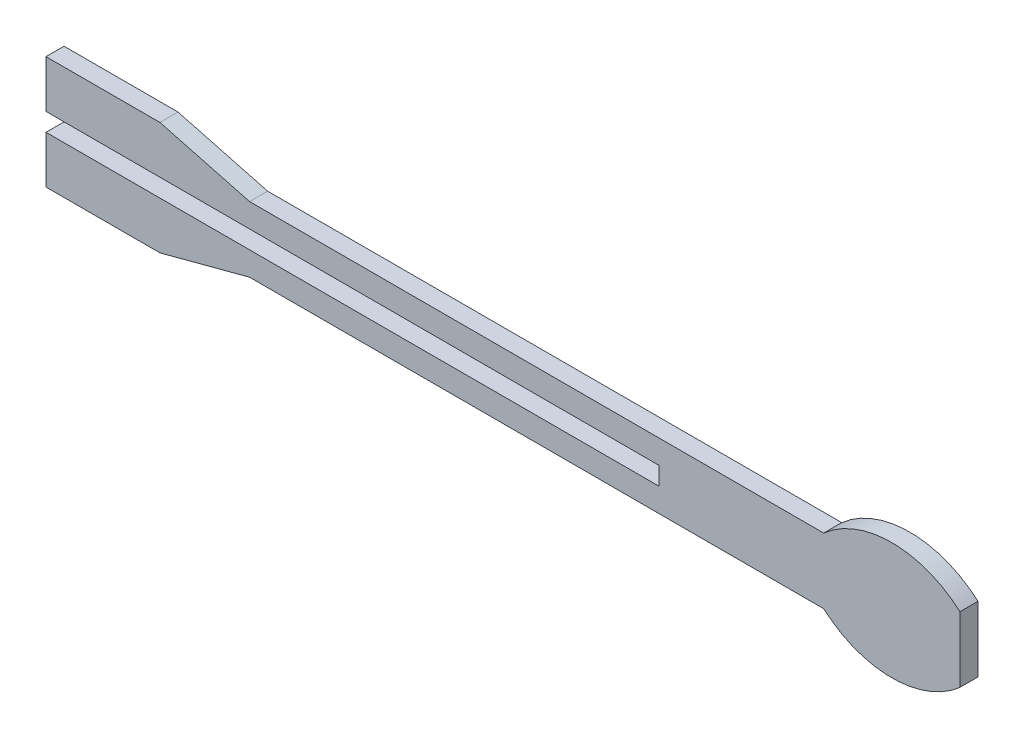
ISO-10303-21;
HEADER;
FILE_DESCRIPTION(('STEP AP214'),'2;1');
FILE_NAME('part.step','',(''),(''),'','','');
FILE_SCHEMA(('AUTOMOTIVE_DESIGN { 1 0 10303 214 1 1 1 1 }'));
ENDSEC;
DATA;
#1=APPLICATION_CONTEXT('core data for automotive mechanical design processes');
#2=APPLICATION_PROTOCOL_DEFINITION('international standard','automotive_design',2000,#1);
#3=PRODUCT_CONTEXT('',#1,'mechanical');
#4=PRODUCT('Part','Part','',(#3));
#5=PRODUCT_RELATED_PRODUCT_CATEGORY('part','',(#4));
#6=PRODUCT_DEFINITION_FORMATION('','',#4);
#7=PRODUCT_DEFINITION_CONTEXT('part definition',#1,'design');
#8=PRODUCT_DEFINITION('design','',#6,#7);
#9=PRODUCT_DEFINITION_SHAPE('','',#8);
#10=(LENGTH_UNIT() NAMED_UNIT(*) SI_UNIT(.MILLI.,.METRE.));
#11=(NAMED_UNIT(*) PLANE_ANGLE_UNIT() SI_UNIT($,.RADIAN.));
#12=(NAMED_UNIT(*) SI_UNIT($,.STERADIAN.) SOLID_ANGLE_UNIT());
#13=UNCERTAINTY_MEASURE_WITH_UNIT(LENGTH_MEASURE(1.E-05),#10,'distance_accuracy_value','');
#14=(GEOMETRIC_REPRESENTATION_CONTEXT(3) GLOBAL_UNCERTAINTY_ASSIGNED_CONTEXT((#13)) GLOBAL_UNIT_ASSIGNED_CONTEXT((#10,
#11,#12)) REPRESENTATION_CONTEXT('',''));
#15=CARTESIAN_POINT('',(0.,0.,0.));
#16=DIRECTION('',(0.,0.,1.));
#17=DIRECTION('',(1.,0.,0.));
#18=AXIS2_PLACEMENT_3D('',#15,#16,#17);
#19=CARTESIAN_POINT('',(50.1353134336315,-1.52399999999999,1.524));
#20=DIRECTION('',(1.,0.,0.));
#21=DIRECTION('',(0.,0.,-1.));
#22=AXIS2_PLACEMENT_3D('',#19,#20,#21);
#23=PLANE('',#22);
#24=DIRECTION('',(0.,-1.,0.));
#25=VECTOR('',#24,1.);
#26=CARTESIAN_POINT('',(50.1353134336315,-1.52399999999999,0.));
#27=LINE('',#26,#25);
#28=CARTESIAN_POINT('',(50.1353134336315,0.,0.));
#29=VERTEX_POINT('',#28);
#30=CARTESIAN_POINT('',(50.1353134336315,-1.52399999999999,0.));
#31=VERTEX_POINT('',#30);
#32=EDGE_CURVE('E168',#29,#31,#27,.T.);
#33=ORIENTED_EDGE('',*,*,#32,.T.);
#34=DIRECTION('',(0.,0.,-1.));
#35=VECTOR('',#34,1.);
#36=CARTESIAN_POINT('',(50.1353134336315,-1.52399999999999,1.524));
#37=LINE('',#36,#35);
#38=CARTESIAN_POINT('',(50.1353134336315,-1.52399999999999,1.524));
#39=VERTEX_POINT('',#38);
#40=EDGE_CURVE('E11',#39,#31,#37,.T.);
#41=ORIENTED_EDGE('',*,*,#40,.F.);
#42=DIRECTION('',(0.,-1.,0.));
#43=VECTOR('',#42,1.);
#44=CARTESIAN_POINT('',(50.1353134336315,-1.52399999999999,1.524));
#45=LINE('',#44,#43);
#46=CARTESIAN_POINT('',(50.1353134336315,0.,1.524));
#47=VERTEX_POINT('',#46);
#48=EDGE_CURVE('E194',#47,#39,#45,.T.);
#49=ORIENTED_EDGE('',*,*,#48,.F.);
#50=DIRECTION('',(0.,0.,-1.));
#51=VECTOR('',#50,1.);
#52=CARTESIAN_POINT('',(50.1353134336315,0.,1.524));
#53=LINE('',#52,#51);
#54=EDGE_CURVE('E164',#47,#29,#53,.T.);
#55=ORIENTED_EDGE('',*,*,#54,.T.);
#56=EDGE_LOOP('',(#33,#41,#49,#55));
#57=FACE_BOUND('',#56,.T.);
#58=ADVANCED_FACE('F36',(#57),#23,.F.);
#59=CARTESIAN_POINT('',(50.1353134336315,-1.52399999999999,1.524));
#60=DIRECTION('',(0.,-1.,0.));
#61=DIRECTION('',(1.,0.,0.));
#62=AXIS2_PLACEMENT_3D('',#59,#60,#61);
#63=PLANE('',#62);
#64=DIRECTION('',(-1.,0.,0.));
#65=VECTOR('',#64,1.);
#66=CARTESIAN_POINT('',(50.1353134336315,-1.52399999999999,0.));
#67=LINE('',#66,#65);
#68=CARTESIAN_POINT('',(-1.63835231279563,-1.524,0.));
#69=VERTEX_POINT('',#68);
#70=EDGE_CURVE('E171',#31,#69,#67,.T.);
#71=ORIENTED_EDGE('',*,*,#70,.T.);
#72=DIRECTION('',(0.,0.,-1.));
#73=VECTOR('',#72,1.);
#74=CARTESIAN_POINT('',(-1.63835231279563,-1.524,1.524));
#75=LINE('',#74,#73);
#76=CARTESIAN_POINT('',(-1.63835231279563,-1.524,1.524));
#77=VERTEX_POINT('',#76);
#78=EDGE_CURVE('E44',#77,#69,#75,.T.);
#79=ORIENTED_EDGE('',*,*,#78,.F.);
#80=DIRECTION('',(-1.,0.,0.));
#81=VECTOR('',#80,1.);
#82=CARTESIAN_POINT('',(50.1353134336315,-1.52399999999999,1.524));
#83=LINE('',#82,#81);
#84=EDGE_CURVE('E113',#39,#77,#83,.T.);
#85=ORIENTED_EDGE('',*,*,#84,.F.);
#86=ORIENTED_EDGE('',*,*,#40,.T.);
#87=EDGE_LOOP('',(#71,#79,#85,#86));
#88=FACE_BOUND('',#87,.T.);
#89=ADVANCED_FACE('F282',(#88),#63,.F.);
#90=CARTESIAN_POINT('',(-1.63835231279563,-1.524,1.524));
#91=DIRECTION('',(1.,0.,0.));
#92=DIRECTION('',(0.,0.,-1.));
#93=AXIS2_PLACEMENT_3D('',#90,#91,#92);
#94=PLANE('',#93);
#95=DIRECTION('',(0.,-1.,0.));
#96=VECTOR('',#95,1.);
#97=CARTESIAN_POINT('',(-1.63835231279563,-1.524,0.));
#98=LINE('',#97,#96);
#99=CARTESIAN_POINT('',(-1.63835231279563,-5.53152575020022,0.));
#100=VERTEX_POINT('',#99);
#101=EDGE_CURVE('E173',#69,#100,#98,.T.);
#102=ORIENTED_EDGE('',*,*,#101,.T.);
#103=DIRECTION('',(0.,0.,-1.));
#104=VECTOR('',#103,1.);
#105=CARTESIAN_POINT('',(-1.63835231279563,-5.53152575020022,1.524));
#106=LINE('',#105,#104);
#107=CARTESIAN_POINT('',(-1.63835231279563,-5.53152575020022,1.524));
#108=VERTEX_POINT('',#107);
#109=EDGE_CURVE('E219',#108,#100,#106,.T.);
#110=ORIENTED_EDGE('',*,*,#109,.F.);
#111=DIRECTION('',(0.,-1.,0.));
#112=VECTOR('',#111,1.);
#113=CARTESIAN_POINT('',(-1.63835231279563,-1.524,1.524));
#114=LINE('',#113,#112);
#115=EDGE_CURVE('E227',#77,#108,#114,.T.);
#116=ORIENTED_EDGE('',*,*,#115,.F.);
#117=ORIENTED_EDGE('',*,*,#78,.T.);
#118=EDGE_LOOP('',(#102,#110,#116,#117));
#119=FACE_BOUND('',#118,.T.);
#120=ADVANCED_FACE('F225',(#119),#94,.F.);
#121=CARTESIAN_POINT('',(-1.63835231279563,-5.53152575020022,1.524));
#122=DIRECTION('',(0.,1.,0.));
#123=DIRECTION('',(0.,0.,1.));
#124=AXIS2_PLACEMENT_3D('',#121,#122,#123);
#125=PLANE('',#124);
#126=DIRECTION('',(1.,0.,0.));
#127=VECTOR('',#126,1.);
#128=CARTESIAN_POINT('',(-1.63835231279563,-5.53152575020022,0.));
#129=LINE('',#128,#127);
#130=CARTESIAN_POINT('',(7.98004005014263,-5.53152575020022,0.));
#131=VERTEX_POINT('',#130);
#132=EDGE_CURVE('E175',#100,#131,#129,.T.);
#133=ORIENTED_EDGE('',*,*,#132,.T.);
#134=DIRECTION('',(0.,0.,-1.));
#135=VECTOR('',#134,1.);
#136=CARTESIAN_POINT('',(7.98004005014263,-5.53152575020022,1.524));
#137=LINE('',#136,#135);
#138=CARTESIAN_POINT('',(7.98004005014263,-5.53152575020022,1.524));
#139=VERTEX_POINT('',#138);
#140=EDGE_CURVE('E216',#139,#131,#137,.T.);
#141=ORIENTED_EDGE('',*,*,#140,.F.);
#142=DIRECTION('',(1.,0.,0.));
#143=VECTOR('',#142,1.);
#144=CARTESIAN_POINT('',(-1.63835231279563,-5.53152575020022,1.524));
#145=LINE('',#144,#143);
#146=EDGE_CURVE('E245',#108,#139,#145,.T.);
#147=ORIENTED_EDGE('',*,*,#146,.F.);
#148=ORIENTED_EDGE('',*,*,#109,.T.);
#149=EDGE_LOOP('',(#133,#141,#147,#148));
#150=FACE_BOUND('',#149,.T.);
#151=ADVANCED_FACE('F236',(#150),#125,.F.);
#152=CARTESIAN_POINT('',(7.98004005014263,-5.53152575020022,1.524));
#153=DIRECTION('',(-0.255779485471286,0.966735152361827,0.));
#154=DIRECTION('',(-0.966735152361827,-0.255779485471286,0.));
#155=AXIS2_PLACEMENT_3D('',#152,#153,#154);
#156=PLANE('',#155);
#157=DIRECTION('',(0.966735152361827,0.255779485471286,0.));
#158=VECTOR('',#157,1.);
#159=CARTESIAN_POINT('',(7.98004005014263,-5.53152575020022,0.));
#160=LINE('',#159,#158);
#161=CARTESIAN_POINT('',(15.5533917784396,-3.52776287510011,0.));
#162=VERTEX_POINT('',#161);
#163=EDGE_CURVE('E177',#131,#162,#160,.T.);
#164=ORIENTED_EDGE('',*,*,#163,.T.);
#165=DIRECTION('',(0.,0.,-1.));
#166=VECTOR('',#165,1.);
#167=CARTESIAN_POINT('',(15.5533917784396,-3.52776287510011,1.524));
#168=LINE('',#167,#166);
#169=CARTESIAN_POINT('',(15.5533917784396,-3.52776287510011,1.524));
#170=VERTEX_POINT('',#169);
#171=EDGE_CURVE('E213',#170,#162,#168,.T.);
#172=ORIENTED_EDGE('',*,*,#171,.F.);
#173=DIRECTION('',(0.966735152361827,0.255779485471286,0.));
#174=VECTOR('',#173,1.);
#175=CARTESIAN_POINT('',(7.98004005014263,-5.53152575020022,1.524));
#176=LINE('',#175,#174);
#177=EDGE_CURVE('E242',#139,#170,#176,.T.);
#178=ORIENTED_EDGE('',*,*,#177,.F.);
#179=ORIENTED_EDGE('',*,*,#140,.T.);
#180=EDGE_LOOP('',(#164,#172,#178,#179));
#181=FACE_BOUND('',#180,.T.);
#182=ADVANCED_FACE('F240',(#181),#156,.F.);
#183=CARTESIAN_POINT('',(15.5533917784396,-3.52776287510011,1.524));
#184=DIRECTION('',(0.,1.,0.));
#185=DIRECTION('',(0.,0.,1.));
#186=AXIS2_PLACEMENT_3D('',#183,#184,#185);
#187=PLANE('',#186);
#188=DIRECTION('',(1.,0.,0.));
#189=VECTOR('',#188,1.);
#190=CARTESIAN_POINT('',(15.5533917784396,-3.52776287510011,0.));
#191=LINE('',#190,#189);
#192=CARTESIAN_POINT('',(64.0278062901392,-3.52776287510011,0.));
#193=VERTEX_POINT('',#192);
#194=EDGE_CURVE('E179',#162,#193,#191,.T.);
#195=ORIENTED_EDGE('',*,*,#194,.T.);
#196=DIRECTION('',(0.,0.,-1.));
#197=VECTOR('',#196,1.);
#198=CARTESIAN_POINT('',(64.0278062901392,-3.52776287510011,1.524));
#199=LINE('',#198,#197);
#200=CARTESIAN_POINT('',(64.0278062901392,-3.52776287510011,1.524));
#201=VERTEX_POINT('',#200);
#202=EDGE_CURVE('E210',#201,#193,#199,.T.);
#203=ORIENTED_EDGE('',*,*,#202,.F.);
#204=DIRECTION('',(1.,0.,0.));
#205=VECTOR('',#204,1.);
#206=CARTESIAN_POINT('',(15.5533917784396,-3.52776287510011,1.524));
#207=LINE('',#206,#205);
#208=EDGE_CURVE('E244',#170,#201,#207,.T.);
#209=ORIENTED_EDGE('',*,*,#208,.F.);
#210=ORIENTED_EDGE('',*,*,#171,.T.);
#211=EDGE_LOOP('',(#195,#203,#209,#210));
#212=FACE_BOUND('',#211,.T.);
#213=ADVANCED_FACE('F295',(#212),#187,.F.);
#214=CARTESIAN_POINT('',(69.7815598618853,2.96458617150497,1.524));
#215=DIRECTION('',(0.,0.,-1.));
#216=DIRECTION('',(-1.,0.,0.));
#217=AXIS2_PLACEMENT_3D('',#214,#215,#216);
#218=CYLINDRICAL_SURFACE('',#217,8.67503753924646);
#219=CARTESIAN_POINT('',(69.7815598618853,2.96458617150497,0.));
#220=DIRECTION('',(0.,0.,1.));
#221=DIRECTION('',(-1.,0.,0.));
#222=AXIS2_PLACEMENT_3D('',#219,#220,#221);
#223=CIRCLE('',#222,8.67503753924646);
#224=CARTESIAN_POINT('',(75.5353134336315,-3.52776287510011,0.));
#225=VERTEX_POINT('',#224);
#226=EDGE_CURVE('E181',#193,#225,#223,.T.);
#227=ORIENTED_EDGE('',*,*,#226,.T.);
#228=DIRECTION('',(0.,0.,-1.));
#229=VECTOR('',#228,1.);
#230=CARTESIAN_POINT('',(75.5353134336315,-3.52776287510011,1.524));
#231=LINE('',#230,#229);
#232=CARTESIAN_POINT('',(75.5353134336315,-3.52776287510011,1.524));
#233=VERTEX_POINT('',#232);
#234=EDGE_CURVE('E207',#233,#225,#231,.T.);
#235=ORIENTED_EDGE('',*,*,#234,.F.);
#236=CARTESIAN_POINT('',(69.7815598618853,2.96458617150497,1.524));
#237=DIRECTION('',(0.,0.,1.));
#238=DIRECTION('',(-1.,0.,0.));
#239=AXIS2_PLACEMENT_3D('',#236,#237,#238);
#240=CIRCLE('',#239,8.67503753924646);
#241=EDGE_CURVE('E247',#201,#233,#240,.T.);
#242=ORIENTED_EDGE('',*,*,#241,.F.);
#243=ORIENTED_EDGE('',*,*,#202,.T.);
#244=EDGE_LOOP('',(#227,#235,#242,#243));
#245=FACE_BOUND('',#244,.T.);
#246=ADVANCED_FACE('F298',(#245),#218,.T.);
#247=CARTESIAN_POINT('',(75.5353134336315,-3.52776287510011,1.524));
#248=DIRECTION('',(-1.,0.,0.));
#249=DIRECTION('',(0.,0.,1.));
#250=AXIS2_PLACEMENT_3D('',#247,#248,#249);
#251=PLANE('',#250);
#252=DIRECTION('',(0.,1.,0.));
#253=VECTOR('',#252,1.);
#254=CARTESIAN_POINT('',(75.5353134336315,-3.52776287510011,0.));
#255=LINE('',#254,#253);
#256=CARTESIAN_POINT('',(75.5353134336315,2.00376287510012,0.));
#257=VERTEX_POINT('',#256);
#258=EDGE_CURVE('E183',#225,#257,#255,.T.);
#259=ORIENTED_EDGE('',*,*,#258,.T.);
#260=DIRECTION('',(0.,0.,-1.));
#261=VECTOR('',#260,1.);
#262=CARTESIAN_POINT('',(75.5353134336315,2.00376287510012,1.524));
#263=LINE('',#262,#261);
#264=CARTESIAN_POINT('',(75.5353134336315,2.00376287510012,1.524));
#265=VERTEX_POINT('',#264);
#266=EDGE_CURVE('E204',#265,#257,#263,.T.);
#267=ORIENTED_EDGE('',*,*,#266,.F.);
#268=DIRECTION('',(0.,1.,0.));
#269=VECTOR('',#268,1.);
#270=CARTESIAN_POINT('',(75.5353134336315,-3.52776287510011,1.524));
#271=LINE('',#270,#269);
#272=EDGE_CURVE('E253',#233,#265,#271,.T.);
#273=ORIENTED_EDGE('',*,*,#272,.F.);
#274=ORIENTED_EDGE('',*,*,#234,.T.);
#275=EDGE_LOOP('',(#259,#267,#273,#274));
#276=FACE_BOUND('',#275,.T.);
#277=ADVANCED_FACE('F302',(#276),#251,.F.);
#278=CARTESIAN_POINT('',(69.7815598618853,-4.48858617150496,1.524));
#279=DIRECTION('',(0.,0.,-1.));
#280=DIRECTION('',(-1.,0.,0.));
#281=AXIS2_PLACEMENT_3D('',#278,#279,#280);
#282=CYLINDRICAL_SURFACE('',#281,8.67503753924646);
#283=CARTESIAN_POINT('',(69.7815598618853,-4.48858617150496,0.));
#284=DIRECTION('',(0.,0.,1.));
#285=DIRECTION('',(1.,0.,0.));
#286=AXIS2_PLACEMENT_3D('',#283,#284,#285);
#287=CIRCLE('',#286,8.67503753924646);
#288=CARTESIAN_POINT('',(64.0278062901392,2.00376287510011,0.));
#289=VERTEX_POINT('',#288);
#290=EDGE_CURVE('E185',#257,#289,#287,.T.);
#291=ORIENTED_EDGE('',*,*,#290,.T.);
#292=DIRECTION('',(0.,0.,-1.));
#293=VECTOR('',#292,1.);
#294=CARTESIAN_POINT('',(64.0278062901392,2.00376287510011,1.524));
#295=LINE('',#294,#293);
#296=CARTESIAN_POINT('',(64.0278062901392,2.00376287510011,1.524));
#297=VERTEX_POINT('',#296);
#298=EDGE_CURVE('E201',#297,#289,#295,.T.);
#299=ORIENTED_EDGE('',*,*,#298,.F.);
#300=CARTESIAN_POINT('',(69.7815598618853,-4.48858617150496,1.524));
#301=DIRECTION('',(0.,0.,1.));
#302=DIRECTION('',(1.,0.,0.));
#303=AXIS2_PLACEMENT_3D('',#300,#301,#302);
#304=CIRCLE('',#303,8.67503753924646);
#305=EDGE_CURVE('E255',#265,#297,#304,.T.);
#306=ORIENTED_EDGE('',*,*,#305,.F.);
#307=ORIENTED_EDGE('',*,*,#266,.T.);
#308=EDGE_LOOP('',(#291,#299,#306,#307));
#309=FACE_BOUND('',#308,.T.);
#310=ADVANCED_FACE('F306',(#309),#282,.T.);
#311=CARTESIAN_POINT('',(15.5533917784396,2.00376287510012,1.524));
#312=DIRECTION('',(0.,-1.,0.));
#313=DIRECTION('',(0.,0.,-1.));
#314=AXIS2_PLACEMENT_3D('',#311,#312,#313);
#315=PLANE('',#314);
#316=DIRECTION('',(-1.,0.,0.));
#317=VECTOR('',#316,1.);
#318=CARTESIAN_POINT('',(15.5533917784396,2.00376287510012,0.));
#319=LINE('',#318,#317);
#320=CARTESIAN_POINT('',(15.5533917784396,2.00376287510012,0.));
#321=VERTEX_POINT('',#320);
#322=EDGE_CURVE('E187',#289,#321,#319,.T.);
#323=ORIENTED_EDGE('',*,*,#322,.T.);
#324=DIRECTION('',(0.,0.,-1.));
#325=VECTOR('',#324,1.);
#326=CARTESIAN_POINT('',(15.5533917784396,2.00376287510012,1.524));
#327=LINE('',#326,#325);
#328=CARTESIAN_POINT('',(15.5533917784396,2.00376287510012,1.524));
#329=VERTEX_POINT('',#328);
#330=EDGE_CURVE('E198',#329,#321,#327,.T.);
#331=ORIENTED_EDGE('',*,*,#330,.F.);
#332=DIRECTION('',(-1.,0.,0.));
#333=VECTOR('',#332,1.);
#334=CARTESIAN_POINT('',(15.5533917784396,2.00376287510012,1.524));
#335=LINE('',#334,#333);
#336=EDGE_CURVE('E257',#297,#329,#335,.T.);
#337=ORIENTED_EDGE('',*,*,#336,.F.);
#338=ORIENTED_EDGE('',*,*,#298,.T.);
#339=EDGE_LOOP('',(#323,#331,#337,#338));
#340=FACE_BOUND('',#339,.T.);
#341=ADVANCED_FACE('F263',(#340),#315,.F.);
#342=CARTESIAN_POINT('',(7.98004005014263,4.00752575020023,1.524));
#343=DIRECTION('',(-0.255779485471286,-0.966735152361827,0.));
#344=DIRECTION('',(0.966735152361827,-0.255779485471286,0.));
#345=AXIS2_PLACEMENT_3D('',#342,#343,#344);
#346=PLANE('',#345);
#347=DIRECTION('',(-0.966735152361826,0.255779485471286,0.));
#348=VECTOR('',#347,1.);
#349=CARTESIAN_POINT('',(7.98004005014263,4.00752575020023,0.));
#350=LINE('',#349,#348);
#351=CARTESIAN_POINT('',(7.98004005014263,4.00752575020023,0.));
#352=VERTEX_POINT('',#351);
#353=EDGE_CURVE('E189',#321,#352,#350,.T.);
#354=ORIENTED_EDGE('',*,*,#353,.T.);
#355=DIRECTION('',(0.,0.,-1.));
#356=VECTOR('',#355,1.);
#357=CARTESIAN_POINT('',(7.98004005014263,4.00752575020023,1.524));
#358=LINE('',#357,#356);
#359=CARTESIAN_POINT('',(7.98004005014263,4.00752575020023,1.524));
#360=VERTEX_POINT('',#359);
#361=EDGE_CURVE('E159',#360,#352,#358,.T.);
#362=ORIENTED_EDGE('',*,*,#361,.F.);
#363=DIRECTION('',(-0.966735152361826,0.255779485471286,0.));
#364=VECTOR('',#363,1.);
#365=CARTESIAN_POINT('',(7.98004005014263,4.00752575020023,1.524));
#366=LINE('',#365,#364);
#367=EDGE_CURVE('E150',#329,#360,#366,.T.);
#368=ORIENTED_EDGE('',*,*,#367,.F.);
#369=ORIENTED_EDGE('',*,*,#330,.T.);
#370=EDGE_LOOP('',(#354,#362,#368,#369));
#371=FACE_BOUND('',#370,.T.);
#372=ADVANCED_FACE('F267',(#371),#346,.F.);
#373=CARTESIAN_POINT('',(-1.63835231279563,4.00752575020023,1.524));
#374=DIRECTION('',(0.,-1.,0.));
#375=DIRECTION('',(0.,0.,-1.));
#376=AXIS2_PLACEMENT_3D('',#373,#374,#375);
#377=PLANE('',#376);
#378=DIRECTION('',(-1.,0.,0.));
#379=VECTOR('',#378,1.);
#380=CARTESIAN_POINT('',(-1.63835231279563,4.00752575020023,0.));
#381=LINE('',#380,#379);
#382=CARTESIAN_POINT('',(-1.63835231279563,4.00752575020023,0.));
#383=VERTEX_POINT('',#382);
#384=EDGE_CURVE('E158',#352,#383,#381,.T.);
#385=ORIENTED_EDGE('',*,*,#384,.T.);
#386=DIRECTION('',(0.,0.,-1.));
#387=VECTOR('',#386,1.);
#388=CARTESIAN_POINT('',(-1.63835231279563,4.00752575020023,1.524));
#389=LINE('',#388,#387);
#390=CARTESIAN_POINT('',(-1.63835231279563,4.00752575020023,1.524));
#391=VERTEX_POINT('',#390);
#392=EDGE_CURVE('E155',#391,#383,#389,.T.);
#393=ORIENTED_EDGE('',*,*,#392,.F.);
#394=DIRECTION('',(-1.,0.,0.));
#395=VECTOR('',#394,1.);
#396=CARTESIAN_POINT('',(-1.63835231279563,4.00752575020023,1.524));
#397=LINE('',#396,#395);
#398=EDGE_CURVE('E144',#360,#391,#397,.T.);
#399=ORIENTED_EDGE('',*,*,#398,.F.);
#400=ORIENTED_EDGE('',*,*,#361,.T.);
#401=EDGE_LOOP('',(#385,#393,#399,#400));
#402=FACE_BOUND('',#401,.T.);
#403=ADVANCED_FACE('F156',(#402),#377,.F.);
#404=CARTESIAN_POINT('',(-1.63835231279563,0.,1.524));
#405=DIRECTION('',(1.,0.,0.));
#406=DIRECTION('',(0.,0.,-1.));
#407=AXIS2_PLACEMENT_3D('',#404,#405,#406);
#408=PLANE('',#407);
#409=DIRECTION('',(0.,-1.,0.));
#410=VECTOR('',#409,1.);
#411=CARTESIAN_POINT('',(-1.63835231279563,0.,0.));
#412=LINE('',#411,#410);
#413=CARTESIAN_POINT('',(-1.63835231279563,0.,0.));
#414=VERTEX_POINT('',#413);
#415=EDGE_CURVE('E99',#383,#414,#412,.T.);
#416=ORIENTED_EDGE('',*,*,#415,.T.);
#417=DIRECTION('',(0.,0.,-1.));
#418=VECTOR('',#417,1.);
#419=CARTESIAN_POINT('',(-1.63835231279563,0.,1.524));
#420=LINE('',#419,#418);
#421=CARTESIAN_POINT('',(-1.63835231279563,0.,1.524));
#422=VERTEX_POINT('',#421);
#423=EDGE_CURVE('E160',#422,#414,#420,.T.);
#424=ORIENTED_EDGE('',*,*,#423,.F.);
#425=DIRECTION('',(0.,-1.,0.));
#426=VECTOR('',#425,1.);
#427=CARTESIAN_POINT('',(-1.63835231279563,0.,1.524));
#428=LINE('',#427,#426);
#429=EDGE_CURVE('E148',#391,#422,#428,.T.);
#430=ORIENTED_EDGE('',*,*,#429,.F.);
#431=ORIENTED_EDGE('',*,*,#392,.T.);
#432=EDGE_LOOP('',(#416,#424,#430,#431));
#433=FACE_BOUND('',#432,.T.);
#434=ADVANCED_FACE('F162',(#433),#408,.F.);
#435=CARTESIAN_POINT('',(50.1353134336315,0.,1.524));
#436=DIRECTION('',(0.,1.,0.));
#437=DIRECTION('',(-1.,0.,0.));
#438=AXIS2_PLACEMENT_3D('',#435,#436,#437);
#439=PLANE('',#438);
#440=DIRECTION('',(1.,0.,0.));
#441=VECTOR('',#440,1.);
#442=CARTESIAN_POINT('',(50.1353134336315,0.,0.));
#443=LINE('',#442,#441);
#444=EDGE_CURVE('E105',#414,#29,#443,.T.);
#445=ORIENTED_EDGE('',*,*,#444,.T.);
#446=ORIENTED_EDGE('',*,*,#54,.F.);
#447=DIRECTION('',(1.,0.,0.));
#448=VECTOR('',#447,1.);
#449=CARTESIAN_POINT('',(50.1353134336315,0.,1.524));
#450=LINE('',#449,#448);
#451=EDGE_CURVE('E52',#422,#47,#450,.T.);
#452=ORIENTED_EDGE('',*,*,#451,.F.);
#453=ORIENTED_EDGE('',*,*,#423,.T.);
#454=EDGE_LOOP('',(#445,#446,#452,#453));
#455=FACE_BOUND('',#454,.T.);
#456=ADVANCED_FACE('F271',(#455),#439,.F.);
#457=CARTESIAN_POINT('',(69.7815598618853,-4.48858617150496,1.524));
#458=DIRECTION('',(0.,0.,1.));
#459=DIRECTION('',(1.,0.,0.));
#460=AXIS2_PLACEMENT_3D('',#457,#458,#459);
#461=PLANE('',#460);
#462=ORIENTED_EDGE('',*,*,#48,.T.);
#463=ORIENTED_EDGE('',*,*,#84,.T.);
#464=ORIENTED_EDGE('',*,*,#115,.T.);
#465=ORIENTED_EDGE('',*,*,#146,.T.);
#466=ORIENTED_EDGE('',*,*,#177,.T.);
#467=ORIENTED_EDGE('',*,*,#208,.T.);
#468=ORIENTED_EDGE('',*,*,#241,.T.);
#469=ORIENTED_EDGE('',*,*,#272,.T.);
#470=ORIENTED_EDGE('',*,*,#305,.T.);
#471=ORIENTED_EDGE('',*,*,#336,.T.);
#472=ORIENTED_EDGE('',*,*,#367,.T.);
#473=ORIENTED_EDGE('',*,*,#398,.T.);
#474=ORIENTED_EDGE('',*,*,#429,.T.);
#475=ORIENTED_EDGE('',*,*,#451,.T.);
#476=EDGE_LOOP('',(#462,#463,#464,#465,#466,#467,#468,#469,#470,#471,#472,#473,#474,#475));
#477=FACE_BOUND('',#476,.T.);
#478=ADVANCED_FACE('F146',(#477),#461,.T.);
#479=CARTESIAN_POINT('',(69.7815598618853,-4.48858617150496,0.));
#480=DIRECTION('',(0.,0.,1.));
#481=DIRECTION('',(1.,0.,0.));
#482=AXIS2_PLACEMENT_3D('',#479,#480,#481);
#483=PLANE('',#482);
#484=ORIENTED_EDGE('',*,*,#32,.F.);
#485=ORIENTED_EDGE('',*,*,#444,.F.);
#486=ORIENTED_EDGE('',*,*,#415,.F.);
#487=ORIENTED_EDGE('',*,*,#384,.F.);
#488=ORIENTED_EDGE('',*,*,#353,.F.);
#489=ORIENTED_EDGE('',*,*,#322,.F.);
#490=ORIENTED_EDGE('',*,*,#290,.F.);
#491=ORIENTED_EDGE('',*,*,#258,.F.);
#492=ORIENTED_EDGE('',*,*,#226,.F.);
#493=ORIENTED_EDGE('',*,*,#194,.F.);
#494=ORIENTED_EDGE('',*,*,#163,.F.);
#495=ORIENTED_EDGE('',*,*,#132,.F.);
#496=ORIENTED_EDGE('',*,*,#101,.F.);
#497=ORIENTED_EDGE('',*,*,#70,.F.);
#498=EDGE_LOOP('',(#484,#485,#486,#487,#488,#489,#490,#491,#492,#493,#494,#495,#496,#497));
#499=FACE_BOUND('',#498,.T.);
#500=ADVANCED_FACE('F231',(#499),#483,.F.);
#501=CLOSED_SHELL('',(#58,#89,#120,#151,#182,#213,#246,#277,#310,#341,#372,#403,#434,#456,#478,#500));
#502=MANIFOLD_SOLID_BREP('B2',#501);
#503=ADVANCED_BREP_SHAPE_REPRESENTATION('',(#18,#502),#14);
#504=SHAPE_DEFINITION_REPRESENTATION(#9,#503);
ENDSEC;
END-ISO-10303-21;
